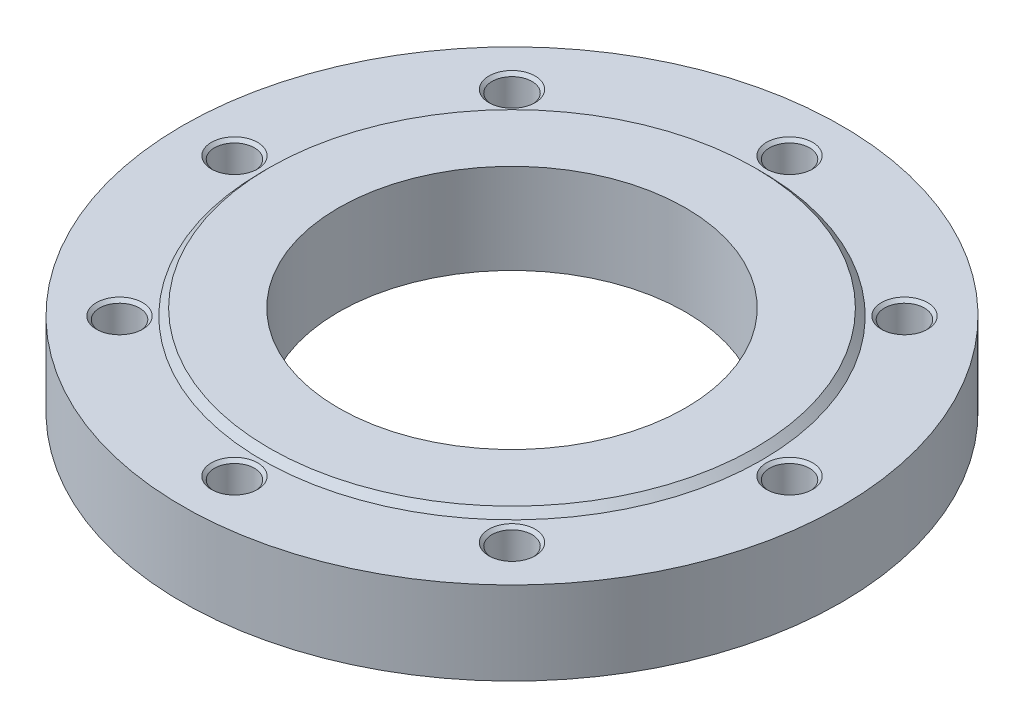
ISO-10303-21;
HEADER;
FILE_DESCRIPTION(('STEP AP214'),'2;1');
FILE_NAME('part.step','',(''),(''),'','','');
FILE_SCHEMA(('AUTOMOTIVE_DESIGN { 1 0 10303 214 1 1 1 1 }'));
ENDSEC;
DATA;
#1=APPLICATION_CONTEXT('core data for automotive mechanical design processes');
#2=APPLICATION_PROTOCOL_DEFINITION('international standard','automotive_design',2000,#1);
#3=PRODUCT_CONTEXT('',#1,'mechanical');
#4=PRODUCT('Part','Part','',(#3));
#5=PRODUCT_RELATED_PRODUCT_CATEGORY('part','',(#4));
#6=PRODUCT_DEFINITION_FORMATION('','',#4);
#7=PRODUCT_DEFINITION_CONTEXT('part definition',#1,'design');
#8=PRODUCT_DEFINITION('design','',#6,#7);
#9=PRODUCT_DEFINITION_SHAPE('','',#8);
#10=(LENGTH_UNIT() NAMED_UNIT(*) SI_UNIT(.MILLI.,.METRE.));
#11=(NAMED_UNIT(*) PLANE_ANGLE_UNIT() SI_UNIT($,.RADIAN.));
#12=(NAMED_UNIT(*) SI_UNIT($,.STERADIAN.) SOLID_ANGLE_UNIT());
#13=UNCERTAINTY_MEASURE_WITH_UNIT(LENGTH_MEASURE(1.E-05),#10,'distance_accuracy_value','');
#14=(GEOMETRIC_REPRESENTATION_CONTEXT(3) GLOBAL_UNCERTAINTY_ASSIGNED_CONTEXT((#13)) GLOBAL_UNIT_ASSIGNED_CONTEXT((#10,
#11,#12)) REPRESENTATION_CONTEXT('',''));
#15=CARTESIAN_POINT('',(0.,0.,0.));
#16=DIRECTION('',(0.,0.,1.));
#17=DIRECTION('',(1.,0.,0.));
#18=AXIS2_PLACEMENT_3D('',#15,#16,#17);
#19=CARTESIAN_POINT('',(0.,18.,0.));
#20=DIRECTION('',(0.,-1.,0.));
#21=DIRECTION('',(1.,0.,0.));
#22=AXIS2_PLACEMENT_3D('',#19,#20,#21);
#23=CYLINDRICAL_SURFACE('',#22,142.5);
#24=CARTESIAN_POINT('',(0.,0.,0.));
#25=DIRECTION('',(0.,1.,0.));
#26=DIRECTION('',(1.,0.,0.));
#27=AXIS2_PLACEMENT_3D('',#24,#25,#26);
#28=CIRCLE('',#27,142.5);
#29=CARTESIAN_POINT('',(142.5,0.,0.));
#30=VERTEX_POINT('',#29);
#31=EDGE_CURVE('E9',#30,#30,#28,.T.);
#32=ORIENTED_EDGE('',*,*,#31,.T.);
#33=EDGE_LOOP('',(#32));
#34=FACE_BOUND('',#33,.T.);
#35=CARTESIAN_POINT('',(0.,36.,0.));
#36=DIRECTION('',(0.,1.,0.));
#37=DIRECTION('',(1.,0.,0.));
#38=AXIS2_PLACEMENT_3D('',#35,#36,#37);
#39=CIRCLE('',#38,142.5);
#40=CARTESIAN_POINT('',(142.5,36.,0.));
#41=VERTEX_POINT('',#40);
#42=EDGE_CURVE('E147',#41,#41,#39,.T.);
#43=ORIENTED_EDGE('',*,*,#42,.F.);
#44=EDGE_LOOP('',(#43));
#45=FACE_BOUND('',#44,.T.);
#46=ADVANCED_FACE('F15',(#34,#45),#23,.T.);
#47=CARTESIAN_POINT('',(108.75,0.,0.));
#48=DIRECTION('',(0.,-1.,0.));
#49=DIRECTION('',(-1.,0.,0.));
#50=AXIS2_PLACEMENT_3D('',#47,#48,#49);
#51=PLANE('',#50);
#52=CARTESIAN_POINT('',(0.,0.,0.));
#53=DIRECTION('',(0.,1.,0.));
#54=DIRECTION('',(1.,0.,0.));
#55=AXIS2_PLACEMENT_3D('',#52,#53,#54);
#56=CIRCLE('',#55,75.);
#57=CARTESIAN_POINT('',(75.,0.,0.));
#58=VERTEX_POINT('',#57);
#59=EDGE_CURVE('E23',#58,#58,#56,.T.);
#60=ORIENTED_EDGE('',*,*,#59,.T.);
#61=EDGE_LOOP('',(#60));
#62=FACE_BOUND('',#61,.T.);
#63=ORIENTED_EDGE('',*,*,#31,.F.);
#64=EDGE_LOOP('',(#63));
#65=FACE_BOUND('',#64,.T.);
#66=ADVANCED_FACE('F299',(#62,#65),#51,.T.);
#67=CARTESIAN_POINT('',(0.,19.5,0.));
#68=DIRECTION('',(0.,-1.,0.));
#69=DIRECTION('',(1.,0.,0.));
#70=AXIS2_PLACEMENT_3D('',#67,#68,#69);
#71=CYLINDRICAL_SURFACE('',#70,75.);
#72=CARTESIAN_POINT('',(0.,39.,0.));
#73=DIRECTION('',(0.,1.,0.));
#74=DIRECTION('',(1.,0.,0.));
#75=AXIS2_PLACEMENT_3D('',#72,#73,#74);
#76=CIRCLE('',#75,75.);
#77=CARTESIAN_POINT('',(75.,39.,0.));
#78=VERTEX_POINT('',#77);
#79=EDGE_CURVE('E141',#78,#78,#76,.T.);
#80=ORIENTED_EDGE('',*,*,#79,.T.);
#81=EDGE_LOOP('',(#80));
#82=FACE_BOUND('',#81,.T.);
#83=ORIENTED_EDGE('',*,*,#59,.F.);
#84=EDGE_LOOP('',(#83));
#85=FACE_BOUND('',#84,.T.);
#86=ADVANCED_FACE('F142',(#82,#85),#71,.F.);
#87=CARTESIAN_POINT('',(90.,39.,0.));
#88=DIRECTION('',(0.,1.,0.));
#89=DIRECTION('',(1.,0.,0.));
#90=AXIS2_PLACEMENT_3D('',#87,#88,#89);
#91=PLANE('',#90);
#92=CARTESIAN_POINT('',(0.,39.,0.));
#93=DIRECTION('',(0.,1.,0.));
#94=DIRECTION('',(1.,0.,0.));
#95=AXIS2_PLACEMENT_3D('',#92,#93,#94);
#96=CIRCLE('',#95,105.);
#97=CARTESIAN_POINT('',(105.,39.,0.));
#98=VERTEX_POINT('',#97);
#99=EDGE_CURVE('E145',#98,#98,#96,.T.);
#100=ORIENTED_EDGE('',*,*,#99,.T.);
#101=EDGE_LOOP('',(#100));
#102=FACE_BOUND('',#101,.T.);
#103=ORIENTED_EDGE('',*,*,#79,.F.);
#104=EDGE_LOOP('',(#103));
#105=FACE_BOUND('',#104,.T.);
#106=ADVANCED_FACE('F425',(#102,#105),#91,.T.);
#107=CARTESIAN_POINT('',(0.,37.5,0.));
#108=DIRECTION('',(0.,-1.,0.));
#109=DIRECTION('',(1.,0.,0.));
#110=AXIS2_PLACEMENT_3D('',#107,#108,#109);
#111=CONICAL_SURFACE('',#110,106.5,0.785398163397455);
#112=CARTESIAN_POINT('',(0.,36.,0.));
#113=DIRECTION('',(0.,1.,0.));
#114=DIRECTION('',(1.,0.,0.));
#115=AXIS2_PLACEMENT_3D('',#112,#113,#114);
#116=CIRCLE('',#115,108.);
#117=CARTESIAN_POINT('',(108.,36.,0.));
#118=VERTEX_POINT('',#117);
#119=EDGE_CURVE('E151',#118,#118,#116,.T.);
#120=ORIENTED_EDGE('',*,*,#119,.T.);
#121=EDGE_LOOP('',(#120));
#122=FACE_BOUND('',#121,.T.);
#123=ORIENTED_EDGE('',*,*,#99,.F.);
#124=EDGE_LOOP('',(#123));
#125=FACE_BOUND('',#124,.T.);
#126=ADVANCED_FACE('F311',(#122,#125),#111,.T.);
#127=CARTESIAN_POINT('',(125.25,36.,0.));
#128=DIRECTION('',(0.,1.,0.));
#129=DIRECTION('',(1.,0.,0.));
#130=AXIS2_PLACEMENT_3D('',#127,#128,#129);
#131=PLANE('',#130);
#132=ORIENTED_EDGE('',*,*,#42,.T.);
#133=EDGE_LOOP('',(#132));
#134=FACE_BOUND('',#133,.T.);
#135=ORIENTED_EDGE('',*,*,#119,.F.);
#136=EDGE_LOOP('',(#135));
#137=FACE_BOUND('',#136,.T.);
#138=CARTESIAN_POINT('',(120.,36.,0.));
#139=DIRECTION('',(0.,-1.,0.));
#140=DIRECTION('',(1.,0.,0.));
#141=AXIS2_PLACEMENT_3D('',#138,#139,#140);
#142=CIRCLE('',#141,10.);
#143=CARTESIAN_POINT('',(130.,36.,0.));
#144=VERTEX_POINT('',#143);
#145=EDGE_CURVE('E160',#144,#144,#142,.T.);
#146=ORIENTED_EDGE('',*,*,#145,.T.);
#147=EDGE_LOOP('',(#146));
#148=FACE_BOUND('',#147,.T.);
#149=CARTESIAN_POINT('',(84.8528137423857,36.,-84.8528137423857));
#150=DIRECTION('',(0.,-1.,0.));
#151=DIRECTION('',(0.707106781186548,0.,-0.707106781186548));
#152=AXIS2_PLACEMENT_3D('',#149,#150,#151);
#153=CIRCLE('',#152,10.);
#154=CARTESIAN_POINT('',(91.9238815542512,36.,-91.9238815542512));
#155=VERTEX_POINT('',#154);
#156=EDGE_CURVE('E172',#155,#155,#153,.T.);
#157=ORIENTED_EDGE('',*,*,#156,.T.);
#158=EDGE_LOOP('',(#157));
#159=FACE_BOUND('',#158,.T.);
#160=CARTESIAN_POINT('',(0.,36.,-120.));
#161=DIRECTION('',(0.,-1.,0.));
#162=DIRECTION('',(0.,0.,-1.));
#163=AXIS2_PLACEMENT_3D('',#160,#161,#162);
#164=CIRCLE('',#163,10.);
#165=CARTESIAN_POINT('',(0.,36.,-130.));
#166=VERTEX_POINT('',#165);
#167=EDGE_CURVE('E186',#166,#166,#164,.T.);
#168=ORIENTED_EDGE('',*,*,#167,.T.);
#169=EDGE_LOOP('',(#168));
#170=FACE_BOUND('',#169,.T.);
#171=CARTESIAN_POINT('',(-84.8528137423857,36.,-84.8528137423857));
#172=DIRECTION('',(0.,-1.,0.));
#173=DIRECTION('',(-0.707106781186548,0.,-0.707106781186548));
#174=AXIS2_PLACEMENT_3D('',#171,#172,#173);
#175=CIRCLE('',#174,10.);
#176=CARTESIAN_POINT('',(-91.9238815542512,36.,-91.9238815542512));
#177=VERTEX_POINT('',#176);
#178=EDGE_CURVE('E199',#177,#177,#175,.T.);
#179=ORIENTED_EDGE('',*,*,#178,.T.);
#180=EDGE_LOOP('',(#179));
#181=FACE_BOUND('',#180,.T.);
#182=CARTESIAN_POINT('',(-120.,36.,0.));
#183=DIRECTION('',(0.,-1.,0.));
#184=DIRECTION('',(-1.,0.,0.));
#185=AXIS2_PLACEMENT_3D('',#182,#183,#184);
#186=CIRCLE('',#185,10.);
#187=CARTESIAN_POINT('',(-130.,36.,0.));
#188=VERTEX_POINT('',#187);
#189=EDGE_CURVE('E210',#188,#188,#186,.T.);
#190=ORIENTED_EDGE('',*,*,#189,.T.);
#191=EDGE_LOOP('',(#190));
#192=FACE_BOUND('',#191,.T.);
#193=CARTESIAN_POINT('',(-84.8528137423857,36.,84.8528137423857));
#194=DIRECTION('',(0.,-1.,0.));
#195=DIRECTION('',(-0.707106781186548,0.,0.707106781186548));
#196=AXIS2_PLACEMENT_3D('',#193,#194,#195);
#197=CIRCLE('',#196,10.);
#198=CARTESIAN_POINT('',(-91.9238815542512,36.,91.9238815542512));
#199=VERTEX_POINT('',#198);
#200=EDGE_CURVE('E223',#199,#199,#197,.T.);
#201=ORIENTED_EDGE('',*,*,#200,.T.);
#202=EDGE_LOOP('',(#201));
#203=FACE_BOUND('',#202,.T.);
#204=CARTESIAN_POINT('',(0.,36.,120.));
#205=DIRECTION('',(0.,-1.,0.));
#206=DIRECTION('',(0.,0.,1.));
#207=AXIS2_PLACEMENT_3D('',#204,#205,#206);
#208=CIRCLE('',#207,10.);
#209=CARTESIAN_POINT('',(0.,36.,130.));
#210=VERTEX_POINT('',#209);
#211=EDGE_CURVE('E239',#210,#210,#208,.T.);
#212=ORIENTED_EDGE('',*,*,#211,.T.);
#213=EDGE_LOOP('',(#212));
#214=FACE_BOUND('',#213,.T.);
#215=CARTESIAN_POINT('',(84.8528137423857,36.,84.8528137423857));
#216=DIRECTION('',(0.,-1.,0.));
#217=DIRECTION('',(0.707106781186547,0.,0.707106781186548));
#218=AXIS2_PLACEMENT_3D('',#215,#216,#217);
#219=CIRCLE('',#218,10.);
#220=CARTESIAN_POINT('',(91.9238815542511,36.,91.9238815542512));
#221=VERTEX_POINT('',#220);
#222=EDGE_CURVE('E251',#221,#221,#219,.T.);
#223=ORIENTED_EDGE('',*,*,#222,.T.);
#224=EDGE_LOOP('',(#223));
#225=FACE_BOUND('',#224,.T.);
#226=ADVANCED_FACE('F307',(#134,#137,#148,#159,#170,#181,#192,#203,#214,#225),#131,.T.);
#227=CARTESIAN_POINT('',(120.,5.50386219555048,0.));
#228=DIRECTION('',(0.,1.,0.));
#229=DIRECTION('',(1.,0.,0.));
#230=AXIS2_PLACEMENT_3D('',#227,#228,#229);
#231=CONICAL_SURFACE('',#230,4.3234375,1.0471975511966);
#232=CARTESIAN_POINT('',(120.,8.,0.));
#233=DIRECTION('',(0.,-1.,0.));
#234=DIRECTION('',(1.,0.,0.));
#235=AXIS2_PLACEMENT_3D('',#232,#233,#234);
#236=CIRCLE('',#235,8.646875);
#237=CARTESIAN_POINT('',(128.646875,8.,0.));
#238=VERTEX_POINT('',#237);
#239=EDGE_CURVE('E154',#238,#238,#236,.T.);
#240=ORIENTED_EDGE('',*,*,#239,.F.);
#241=EDGE_LOOP('',(#240));
#242=FACE_BOUND('',#241,.T.);
#243=CARTESIAN_POINT('',(120.,3.00772439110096,0.));
#244=VERTEX_POINT('',#243);
#245=VERTEX_LOOP('',#244);
#246=FACE_BOUND('',#245,.T.);
#247=ADVANCED_FACE('F310',(#242,#246),#231,.F.);
#248=CARTESIAN_POINT('',(120.,11.3234375,0.));
#249=DIRECTION('',(0.,1.,0.));
#250=DIRECTION('',(1.,0.,0.));
#251=AXIS2_PLACEMENT_3D('',#248,#249,#250);
#252=CYLINDRICAL_SURFACE('',#251,8.646875);
#253=CARTESIAN_POINT('',(120.,14.646875,0.));
#254=DIRECTION('',(0.,-1.,0.));
#255=DIRECTION('',(1.,0.,0.));
#256=AXIS2_PLACEMENT_3D('',#253,#254,#255);
#257=CIRCLE('',#256,8.646875);
#258=CARTESIAN_POINT('',(128.646875,14.646875,0.));
#259=VERTEX_POINT('',#258);
#260=EDGE_CURVE('E156',#259,#259,#257,.T.);
#261=ORIENTED_EDGE('',*,*,#260,.F.);
#262=EDGE_LOOP('',(#261));
#263=FACE_BOUND('',#262,.T.);
#264=ORIENTED_EDGE('',*,*,#239,.T.);
#265=EDGE_LOOP('',(#264));
#266=FACE_BOUND('',#265,.T.);
#267=ADVANCED_FACE('F563',(#263,#266),#252,.F.);
#268=CARTESIAN_POINT('',(120.,15.3234375,0.));
#269=DIRECTION('',(0.,1.,0.));
#270=DIRECTION('',(1.,0.,0.));
#271=AXIS2_PLACEMENT_3D('',#268,#269,#270);
#272=CONICAL_SURFACE('',#271,9.3234375,0.785398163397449);
#273=CARTESIAN_POINT('',(120.,16.,0.));
#274=DIRECTION('',(0.,-1.,0.));
#275=DIRECTION('',(1.,0.,0.));
#276=AXIS2_PLACEMENT_3D('',#273,#274,#275);
#277=CIRCLE('',#276,10.);
#278=CARTESIAN_POINT('',(130.,16.,0.));
#279=VERTEX_POINT('',#278);
#280=EDGE_CURVE('E157',#279,#279,#277,.T.);
#281=ORIENTED_EDGE('',*,*,#280,.F.);
#282=EDGE_LOOP('',(#281));
#283=FACE_BOUND('',#282,.T.);
#284=ORIENTED_EDGE('',*,*,#260,.T.);
#285=EDGE_LOOP('',(#284));
#286=FACE_BOUND('',#285,.T.);
#287=ADVANCED_FACE('F561',(#283,#286),#272,.F.);
#288=CARTESIAN_POINT('',(129.3234375,16.,0.));
#289=DIRECTION('',(0.,1.,0.));
#290=DIRECTION('',(-1.,0.,0.));
#291=AXIS2_PLACEMENT_3D('',#288,#289,#290);
#292=PLANE('',#291);
#293=CARTESIAN_POINT('',(120.,16.,0.));
#294=DIRECTION('',(0.,-1.,0.));
#295=DIRECTION('',(1.,0.,0.));
#296=AXIS2_PLACEMENT_3D('',#293,#294,#295);
#297=CIRCLE('',#296,8.646875);
#298=CARTESIAN_POINT('',(128.646875,16.,0.));
#299=VERTEX_POINT('',#298);
#300=EDGE_CURVE('E159',#299,#299,#297,.T.);
#301=ORIENTED_EDGE('',*,*,#300,.F.);
#302=EDGE_LOOP('',(#301));
#303=FACE_BOUND('',#302,.T.);
#304=ORIENTED_EDGE('',*,*,#280,.T.);
#305=EDGE_LOOP('',(#304));
#306=FACE_BOUND('',#305,.T.);
#307=ADVANCED_FACE('F488',(#303,#306),#292,.F.);
#308=CARTESIAN_POINT('',(120.,25.3234375,0.));
#309=DIRECTION('',(0.,1.,0.));
#310=DIRECTION('',(1.,0.,0.));
#311=AXIS2_PLACEMENT_3D('',#308,#309,#310);
#312=CYLINDRICAL_SURFACE('',#311,8.646875);
#313=CARTESIAN_POINT('',(120.,34.646875,0.));
#314=DIRECTION('',(0.,-1.,0.));
#315=DIRECTION('',(1.,0.,0.));
#316=AXIS2_PLACEMENT_3D('',#313,#314,#315);
#317=CIRCLE('',#316,8.646875);
#318=CARTESIAN_POINT('',(128.646875,34.646875,0.));
#319=VERTEX_POINT('',#318);
#320=EDGE_CURVE('E162',#319,#319,#317,.T.);
#321=ORIENTED_EDGE('',*,*,#320,.F.);
#322=EDGE_LOOP('',(#321));
#323=FACE_BOUND('',#322,.T.);
#324=ORIENTED_EDGE('',*,*,#300,.T.);
#325=EDGE_LOOP('',(#324));
#326=FACE_BOUND('',#325,.T.);
#327=ADVANCED_FACE('F485',(#323,#326),#312,.F.);
#328=CARTESIAN_POINT('',(120.,35.3234375,0.));
#329=DIRECTION('',(0.,1.,0.));
#330=DIRECTION('',(1.,0.,0.));
#331=AXIS2_PLACEMENT_3D('',#328,#329,#330);
#332=CONICAL_SURFACE('',#331,9.3234375,0.785398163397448);
#333=ORIENTED_EDGE('',*,*,#145,.F.);
#334=EDGE_LOOP('',(#333));
#335=FACE_BOUND('',#334,.T.);
#336=ORIENTED_EDGE('',*,*,#320,.T.);
#337=EDGE_LOOP('',(#336));
#338=FACE_BOUND('',#337,.T.);
#339=ADVANCED_FACE('F487',(#335,#338),#332,.F.);
#340=CARTESIAN_POINT('',(84.8528137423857,5.50386219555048,-84.8528137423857));
#341=DIRECTION('',(0.,1.,0.));
#342=DIRECTION('',(0.707106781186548,0.,-0.707106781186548));
#343=AXIS2_PLACEMENT_3D('',#340,#341,#342);
#344=CONICAL_SURFACE('',#343,4.3234375,1.0471975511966);
#345=CARTESIAN_POINT('',(84.8528137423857,8.,-84.8528137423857));
#346=DIRECTION('',(0.,-1.,0.));
#347=DIRECTION('',(0.707106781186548,0.,-0.707106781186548));
#348=AXIS2_PLACEMENT_3D('',#345,#346,#347);
#349=CIRCLE('',#348,8.646875);
#350=CARTESIAN_POINT('',(90.9670776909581,8.,-90.9670776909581));
#351=VERTEX_POINT('',#350);
#352=EDGE_CURVE('E165',#351,#351,#349,.T.);
#353=ORIENTED_EDGE('',*,*,#352,.F.);
#354=EDGE_LOOP('',(#353));
#355=FACE_BOUND('',#354,.T.);
#356=CARTESIAN_POINT('',(84.8528137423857,3.00772439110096,-84.8528137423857));
#357=VERTEX_POINT('',#356);
#358=VERTEX_LOOP('',#357);
#359=FACE_BOUND('',#358,.T.);
#360=ADVANCED_FACE('F551',(#355,#359),#344,.F.);
#361=CARTESIAN_POINT('',(84.8528137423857,11.3234375,-84.8528137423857));
#362=DIRECTION('',(0.,1.,0.));
#363=DIRECTION('',(0.707106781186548,0.,-0.707106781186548));
#364=AXIS2_PLACEMENT_3D('',#361,#362,#363);
#365=CYLINDRICAL_SURFACE('',#364,8.646875);
#366=CARTESIAN_POINT('',(84.8528137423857,14.646875,-84.8528137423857));
#367=DIRECTION('',(0.,-1.,0.));
#368=DIRECTION('',(0.707106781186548,0.,-0.707106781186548));
#369=AXIS2_PLACEMENT_3D('',#366,#367,#368);
#370=CIRCLE('',#369,8.646875);
#371=CARTESIAN_POINT('',(90.9670776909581,14.646875,-90.9670776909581));
#372=VERTEX_POINT('',#371);
#373=EDGE_CURVE('E166',#372,#372,#370,.T.);
#374=ORIENTED_EDGE('',*,*,#373,.F.);
#375=EDGE_LOOP('',(#374));
#376=FACE_BOUND('',#375,.T.);
#377=ORIENTED_EDGE('',*,*,#352,.T.);
#378=EDGE_LOOP('',(#377));
#379=FACE_BOUND('',#378,.T.);
#380=ADVANCED_FACE('F547',(#376,#379),#365,.F.);
#381=CARTESIAN_POINT('',(84.8528137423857,15.3234375,-84.8528137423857));
#382=DIRECTION('',(0.,1.,0.));
#383=DIRECTION('',(0.707106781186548,0.,-0.707106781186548));
#384=AXIS2_PLACEMENT_3D('',#381,#382,#383);
#385=CONICAL_SURFACE('',#384,9.3234375,0.785398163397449);
#386=CARTESIAN_POINT('',(84.8528137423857,16.,-84.8528137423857));
#387=DIRECTION('',(0.,-1.,0.));
#388=DIRECTION('',(0.707106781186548,0.,-0.707106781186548));
#389=AXIS2_PLACEMENT_3D('',#386,#387,#388);
#390=CIRCLE('',#389,10.);
#391=CARTESIAN_POINT('',(91.9238815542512,16.,-91.9238815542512));
#392=VERTEX_POINT('',#391);
#393=EDGE_CURVE('E168',#392,#392,#390,.T.);
#394=ORIENTED_EDGE('',*,*,#393,.F.);
#395=EDGE_LOOP('',(#394));
#396=FACE_BOUND('',#395,.T.);
#397=ORIENTED_EDGE('',*,*,#373,.T.);
#398=EDGE_LOOP('',(#397));
#399=FACE_BOUND('',#398,.T.);
#400=ADVANCED_FACE('F543',(#396,#399),#385,.F.);
#401=CARTESIAN_POINT('',(91.4454796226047,16.,-91.4454796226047));
#402=DIRECTION('',(0.,1.,0.));
#403=DIRECTION('',(-0.707106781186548,0.,0.707106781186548));
#404=AXIS2_PLACEMENT_3D('',#401,#402,#403);
#405=PLANE('',#404);
#406=CARTESIAN_POINT('',(84.8528137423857,16.,-84.8528137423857));
#407=DIRECTION('',(0.,-1.,0.));
#408=DIRECTION('',(0.707106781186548,0.,-0.707106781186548));
#409=AXIS2_PLACEMENT_3D('',#406,#407,#408);
#410=CIRCLE('',#409,8.646875);
#411=CARTESIAN_POINT('',(90.9670776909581,16.,-90.9670776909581));
#412=VERTEX_POINT('',#411);
#413=EDGE_CURVE('E170',#412,#412,#410,.T.);
#414=ORIENTED_EDGE('',*,*,#413,.F.);
#415=EDGE_LOOP('',(#414));
#416=FACE_BOUND('',#415,.T.);
#417=ORIENTED_EDGE('',*,*,#393,.T.);
#418=EDGE_LOOP('',(#417));
#419=FACE_BOUND('',#418,.T.);
#420=ADVANCED_FACE('F539',(#416,#419),#405,.F.);
#421=CARTESIAN_POINT('',(84.8528137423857,25.3234375,-84.8528137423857));
#422=DIRECTION('',(0.,1.,0.));
#423=DIRECTION('',(0.707106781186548,0.,-0.707106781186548));
#424=AXIS2_PLACEMENT_3D('',#421,#422,#423);
#425=CYLINDRICAL_SURFACE('',#424,8.646875);
#426=CARTESIAN_POINT('',(84.8528137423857,34.646875,-84.8528137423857));
#427=DIRECTION('',(0.,-1.,0.));
#428=DIRECTION('',(0.707106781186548,0.,-0.707106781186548));
#429=AXIS2_PLACEMENT_3D('',#426,#427,#428);
#430=CIRCLE('',#429,8.646875);
#431=CARTESIAN_POINT('',(90.9670776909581,34.646875,-90.9670776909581));
#432=VERTEX_POINT('',#431);
#433=EDGE_CURVE('E175',#432,#432,#430,.T.);
#434=ORIENTED_EDGE('',*,*,#433,.F.);
#435=EDGE_LOOP('',(#434));
#436=FACE_BOUND('',#435,.T.);
#437=ORIENTED_EDGE('',*,*,#413,.T.);
#438=EDGE_LOOP('',(#437));
#439=FACE_BOUND('',#438,.T.);
#440=ADVANCED_FACE('F533',(#436,#439),#425,.F.);
#441=CARTESIAN_POINT('',(84.8528137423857,35.3234375,-84.8528137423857));
#442=DIRECTION('',(0.,1.,0.));
#443=DIRECTION('',(0.707106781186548,0.,-0.707106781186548));
#444=AXIS2_PLACEMENT_3D('',#441,#442,#443);
#445=CONICAL_SURFACE('',#444,9.3234375,0.785398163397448);
#446=ORIENTED_EDGE('',*,*,#156,.F.);
#447=EDGE_LOOP('',(#446));
#448=FACE_BOUND('',#447,.T.);
#449=ORIENTED_EDGE('',*,*,#433,.T.);
#450=EDGE_LOOP('',(#449));
#451=FACE_BOUND('',#450,.T.);
#452=ADVANCED_FACE('F528',(#448,#451),#445,.F.);
#453=CARTESIAN_POINT('',(0.,5.50386219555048,-120.));
#454=DIRECTION('',(0.,1.,0.));
#455=DIRECTION('',(0.,0.,-1.));
#456=AXIS2_PLACEMENT_3D('',#453,#454,#455);
#457=CONICAL_SURFACE('',#456,4.3234375,1.0471975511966);
#458=CARTESIAN_POINT('',(0.,8.,-120.));
#459=DIRECTION('',(0.,-1.,0.));
#460=DIRECTION('',(0.,0.,-1.));
#461=AXIS2_PLACEMENT_3D('',#458,#459,#460);
#462=CIRCLE('',#461,8.646875);
#463=CARTESIAN_POINT('',(0.,8.,-128.646875));
#464=VERTEX_POINT('',#463);
#465=EDGE_CURVE('E177',#464,#464,#462,.T.);
#466=ORIENTED_EDGE('',*,*,#465,.F.);
#467=EDGE_LOOP('',(#466));
#468=FACE_BOUND('',#467,.T.);
#469=CARTESIAN_POINT('',(0.,3.00772439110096,-120.));
#470=VERTEX_POINT('',#469);
#471=VERTEX_LOOP('',#470);
#472=FACE_BOUND('',#471,.T.);
#473=ADVANCED_FACE('F522',(#468,#472),#457,.F.);
#474=CARTESIAN_POINT('',(0.,11.3234375,-120.));
#475=DIRECTION('',(0.,1.,0.));
#476=DIRECTION('',(0.,0.,-1.));
#477=AXIS2_PLACEMENT_3D('',#474,#475,#476);
#478=CYLINDRICAL_SURFACE('',#477,8.646875);
#479=CARTESIAN_POINT('',(0.,14.646875,-120.));
#480=DIRECTION('',(0.,-1.,0.));
#481=DIRECTION('',(0.,0.,-1.));
#482=AXIS2_PLACEMENT_3D('',#479,#480,#481);
#483=CIRCLE('',#482,8.646875);
#484=CARTESIAN_POINT('',(0.,14.646875,-128.646875));
#485=VERTEX_POINT('',#484);
#486=EDGE_CURVE('E179',#485,#485,#483,.T.);
#487=ORIENTED_EDGE('',*,*,#486,.F.);
#488=EDGE_LOOP('',(#487));
#489=FACE_BOUND('',#488,.T.);
#490=ORIENTED_EDGE('',*,*,#465,.T.);
#491=EDGE_LOOP('',(#490));
#492=FACE_BOUND('',#491,.T.);
#493=ADVANCED_FACE('F516',(#489,#492),#478,.F.);
#494=CARTESIAN_POINT('',(0.,15.3234375,-120.));
#495=DIRECTION('',(0.,1.,0.));
#496=DIRECTION('',(0.,0.,-1.));
#497=AXIS2_PLACEMENT_3D('',#494,#495,#496);
#498=CONICAL_SURFACE('',#497,9.3234375,0.785398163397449);
#499=CARTESIAN_POINT('',(0.,16.,-120.));
#500=DIRECTION('',(0.,-1.,0.));
#501=DIRECTION('',(0.,0.,-1.));
#502=AXIS2_PLACEMENT_3D('',#499,#500,#501);
#503=CIRCLE('',#502,10.);
#504=CARTESIAN_POINT('',(0.,16.,-130.));
#505=VERTEX_POINT('',#504);
#506=EDGE_CURVE('E182',#505,#505,#503,.T.);
#507=ORIENTED_EDGE('',*,*,#506,.F.);
#508=EDGE_LOOP('',(#507));
#509=FACE_BOUND('',#508,.T.);
#510=ORIENTED_EDGE('',*,*,#486,.T.);
#511=EDGE_LOOP('',(#510));
#512=FACE_BOUND('',#511,.T.);
#513=ADVANCED_FACE('F505',(#509,#512),#498,.F.);
#514=CARTESIAN_POINT('',(0.,16.,-129.3234375));
#515=DIRECTION('',(0.,1.,0.));
#516=DIRECTION('',(0.,0.,1.));
#517=AXIS2_PLACEMENT_3D('',#514,#515,#516);
#518=PLANE('',#517);
#519=CARTESIAN_POINT('',(0.,16.,-120.));
#520=DIRECTION('',(0.,-1.,0.));
#521=DIRECTION('',(0.,0.,-1.));
#522=AXIS2_PLACEMENT_3D('',#519,#520,#521);
#523=CIRCLE('',#522,8.646875);
#524=CARTESIAN_POINT('',(0.,16.,-128.646875));
#525=VERTEX_POINT('',#524);
#526=EDGE_CURVE('E184',#525,#525,#523,.T.);
#527=ORIENTED_EDGE('',*,*,#526,.F.);
#528=EDGE_LOOP('',(#527));
#529=FACE_BOUND('',#528,.T.);
#530=ORIENTED_EDGE('',*,*,#506,.T.);
#531=EDGE_LOOP('',(#530));
#532=FACE_BOUND('',#531,.T.);
#533=ADVANCED_FACE('F496',(#529,#532),#518,.F.);
#534=CARTESIAN_POINT('',(0.,25.3234375,-120.));
#535=DIRECTION('',(0.,1.,0.));
#536=DIRECTION('',(0.,0.,-1.));
#537=AXIS2_PLACEMENT_3D('',#534,#535,#536);
#538=CYLINDRICAL_SURFACE('',#537,8.646875);
#539=CARTESIAN_POINT('',(0.,34.646875,-120.));
#540=DIRECTION('',(0.,-1.,0.));
#541=DIRECTION('',(0.,0.,-1.));
#542=AXIS2_PLACEMENT_3D('',#539,#540,#541);
#543=CIRCLE('',#542,8.646875);
#544=CARTESIAN_POINT('',(0.,34.646875,-128.646875));
#545=VERTEX_POINT('',#544);
#546=EDGE_CURVE('E188',#545,#545,#543,.T.);
#547=ORIENTED_EDGE('',*,*,#546,.F.);
#548=EDGE_LOOP('',(#547));
#549=FACE_BOUND('',#548,.T.);
#550=ORIENTED_EDGE('',*,*,#526,.T.);
#551=EDGE_LOOP('',(#550));
#552=FACE_BOUND('',#551,.T.);
#553=ADVANCED_FACE('F493',(#549,#552),#538,.F.);
#554=CARTESIAN_POINT('',(0.,35.3234375,-120.));
#555=DIRECTION('',(0.,1.,0.));
#556=DIRECTION('',(0.,0.,-1.));
#557=AXIS2_PLACEMENT_3D('',#554,#555,#556);
#558=CONICAL_SURFACE('',#557,9.3234375,0.785398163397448);
#559=ORIENTED_EDGE('',*,*,#167,.F.);
#560=EDGE_LOOP('',(#559));
#561=FACE_BOUND('',#560,.T.);
#562=ORIENTED_EDGE('',*,*,#546,.T.);
#563=EDGE_LOOP('',(#562));
#564=FACE_BOUND('',#563,.T.);
#565=ADVANCED_FACE('F495',(#561,#564),#558,.F.);
#566=CARTESIAN_POINT('',(-84.8528137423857,5.50386219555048,-84.8528137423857));
#567=DIRECTION('',(0.,1.,0.));
#568=DIRECTION('',(-0.707106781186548,0.,-0.707106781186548));
#569=AXIS2_PLACEMENT_3D('',#566,#567,#568);
#570=CONICAL_SURFACE('',#569,4.3234375,1.0471975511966);
#571=CARTESIAN_POINT('',(-84.8528137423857,8.,-84.8528137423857));
#572=DIRECTION('',(0.,-1.,0.));
#573=DIRECTION('',(-0.707106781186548,0.,-0.707106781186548));
#574=AXIS2_PLACEMENT_3D('',#571,#572,#573);
#575=CIRCLE('',#574,8.646875);
#576=CARTESIAN_POINT('',(-90.9670776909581,8.,-90.9670776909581));
#577=VERTEX_POINT('',#576);
#578=EDGE_CURVE('E190',#577,#577,#575,.T.);
#579=ORIENTED_EDGE('',*,*,#578,.F.);
#580=EDGE_LOOP('',(#579));
#581=FACE_BOUND('',#580,.T.);
#582=CARTESIAN_POINT('',(-84.8528137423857,3.00772439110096,-84.8528137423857));
#583=VERTEX_POINT('',#582);
#584=VERTEX_LOOP('',#583);
#585=FACE_BOUND('',#584,.T.);
#586=ADVANCED_FACE('F502',(#581,#585),#570,.F.);
#587=CARTESIAN_POINT('',(-84.8528137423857,11.3234375,-84.8528137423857));
#588=DIRECTION('',(0.,1.,0.));
#589=DIRECTION('',(-0.707106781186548,0.,-0.707106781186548));
#590=AXIS2_PLACEMENT_3D('',#587,#588,#589);
#591=CYLINDRICAL_SURFACE('',#590,8.646875);
#592=CARTESIAN_POINT('',(-84.8528137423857,14.646875,-84.8528137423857));
#593=DIRECTION('',(0.,-1.,0.));
#594=DIRECTION('',(-0.707106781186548,0.,-0.707106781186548));
#595=AXIS2_PLACEMENT_3D('',#592,#593,#594);
#596=CIRCLE('',#595,8.646875);
#597=CARTESIAN_POINT('',(-90.9670776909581,14.646875,-90.9670776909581));
#598=VERTEX_POINT('',#597);
#599=EDGE_CURVE('E192',#598,#598,#596,.T.);
#600=ORIENTED_EDGE('',*,*,#599,.F.);
#601=EDGE_LOOP('',(#600));
#602=FACE_BOUND('',#601,.T.);
#603=ORIENTED_EDGE('',*,*,#578,.T.);
#604=EDGE_LOOP('',(#603));
#605=FACE_BOUND('',#604,.T.);
#606=ADVANCED_FACE('F687',(#602,#605),#591,.F.);
#607=CARTESIAN_POINT('',(-84.8528137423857,15.3234375,-84.8528137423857));
#608=DIRECTION('',(0.,1.,0.));
#609=DIRECTION('',(-0.707106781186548,0.,-0.707106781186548));
#610=AXIS2_PLACEMENT_3D('',#607,#608,#609);
#611=CONICAL_SURFACE('',#610,9.3234375,0.785398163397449);
#612=CARTESIAN_POINT('',(-84.8528137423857,16.,-84.8528137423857));
#613=DIRECTION('',(0.,-1.,0.));
#614=DIRECTION('',(-0.707106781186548,0.,-0.707106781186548));
#615=AXIS2_PLACEMENT_3D('',#612,#613,#614);
#616=CIRCLE('',#615,10.);
#617=CARTESIAN_POINT('',(-91.9238815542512,16.,-91.9238815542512));
#618=VERTEX_POINT('',#617);
#619=EDGE_CURVE('E194',#618,#618,#616,.T.);
#620=ORIENTED_EDGE('',*,*,#619,.F.);
#621=EDGE_LOOP('',(#620));
#622=FACE_BOUND('',#621,.T.);
#623=ORIENTED_EDGE('',*,*,#599,.T.);
#624=EDGE_LOOP('',(#623));
#625=FACE_BOUND('',#624,.T.);
#626=ADVANCED_FACE('F697',(#622,#625),#611,.F.);
#627=CARTESIAN_POINT('',(-91.4454796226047,16.,-91.4454796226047));
#628=DIRECTION('',(0.,1.,0.));
#629=DIRECTION('',(0.707106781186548,0.,0.707106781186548));
#630=AXIS2_PLACEMENT_3D('',#627,#628,#629);
#631=PLANE('',#630);
#632=CARTESIAN_POINT('',(-84.8528137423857,16.,-84.8528137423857));
#633=DIRECTION('',(0.,-1.,0.));
#634=DIRECTION('',(-0.707106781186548,0.,-0.707106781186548));
#635=AXIS2_PLACEMENT_3D('',#632,#633,#634);
#636=CIRCLE('',#635,8.646875);
#637=CARTESIAN_POINT('',(-90.9670776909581,16.,-90.9670776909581));
#638=VERTEX_POINT('',#637);
#639=EDGE_CURVE('E196',#638,#638,#636,.T.);
#640=ORIENTED_EDGE('',*,*,#639,.F.);
#641=EDGE_LOOP('',(#640));
#642=FACE_BOUND('',#641,.T.);
#643=ORIENTED_EDGE('',*,*,#619,.T.);
#644=EDGE_LOOP('',(#643));
#645=FACE_BOUND('',#644,.T.);
#646=ADVANCED_FACE('F707',(#642,#645),#631,.F.);
#647=CARTESIAN_POINT('',(-84.8528137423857,25.3234375,-84.8528137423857));
#648=DIRECTION('',(0.,1.,0.));
#649=DIRECTION('',(-0.707106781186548,0.,-0.707106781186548));
#650=AXIS2_PLACEMENT_3D('',#647,#648,#649);
#651=CYLINDRICAL_SURFACE('',#650,8.646875);
#652=CARTESIAN_POINT('',(-84.8528137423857,34.646875,-84.8528137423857));
#653=DIRECTION('',(0.,-1.,0.));
#654=DIRECTION('',(-0.707106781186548,0.,-0.707106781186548));
#655=AXIS2_PLACEMENT_3D('',#652,#653,#654);
#656=CIRCLE('',#655,8.646875);
#657=CARTESIAN_POINT('',(-90.9670776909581,34.646875,-90.9670776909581));
#658=VERTEX_POINT('',#657);
#659=EDGE_CURVE('E201',#658,#658,#656,.T.);
#660=ORIENTED_EDGE('',*,*,#659,.F.);
#661=EDGE_LOOP('',(#660));
#662=FACE_BOUND('',#661,.T.);
#663=ORIENTED_EDGE('',*,*,#639,.T.);
#664=EDGE_LOOP('',(#663));
#665=FACE_BOUND('',#664,.T.);
#666=ADVANCED_FACE('F295',(#662,#665),#651,.F.);
#667=CARTESIAN_POINT('',(-84.8528137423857,35.3234375,-84.8528137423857));
#668=DIRECTION('',(0.,1.,0.));
#669=DIRECTION('',(-0.707106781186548,0.,-0.707106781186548));
#670=AXIS2_PLACEMENT_3D('',#667,#668,#669);
#671=CONICAL_SURFACE('',#670,9.3234375,0.785398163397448);
#672=ORIENTED_EDGE('',*,*,#178,.F.);
#673=EDGE_LOOP('',(#672));
#674=FACE_BOUND('',#673,.T.);
#675=ORIENTED_EDGE('',*,*,#659,.T.);
#676=EDGE_LOOP('',(#675));
#677=FACE_BOUND('',#676,.T.);
#678=ADVANCED_FACE('F289',(#674,#677),#671,.F.);
#679=CARTESIAN_POINT('',(-120.,5.50386219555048,0.));
#680=DIRECTION('',(0.,1.,0.));
#681=DIRECTION('',(-1.,0.,0.));
#682=AXIS2_PLACEMENT_3D('',#679,#680,#681);
#683=CONICAL_SURFACE('',#682,4.3234375,1.0471975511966);
#684=CARTESIAN_POINT('',(-120.,8.,0.));
#685=DIRECTION('',(0.,-1.,0.));
#686=DIRECTION('',(-1.,0.,0.));
#687=AXIS2_PLACEMENT_3D('',#684,#685,#686);
#688=CIRCLE('',#687,8.646875);
#689=CARTESIAN_POINT('',(-128.646875,8.,0.));
#690=VERTEX_POINT('',#689);
#691=EDGE_CURVE('E203',#690,#690,#688,.T.);
#692=ORIENTED_EDGE('',*,*,#691,.F.);
#693=EDGE_LOOP('',(#692));
#694=FACE_BOUND('',#693,.T.);
#695=CARTESIAN_POINT('',(-120.,3.00772439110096,0.));
#696=VERTEX_POINT('',#695);
#697=VERTEX_LOOP('',#696);
#698=FACE_BOUND('',#697,.T.);
#699=ADVANCED_FACE('F283',(#694,#698),#683,.F.);
#700=CARTESIAN_POINT('',(-120.,11.3234375,0.));
#701=DIRECTION('',(0.,1.,0.));
#702=DIRECTION('',(-1.,0.,0.));
#703=AXIS2_PLACEMENT_3D('',#700,#701,#702);
#704=CYLINDRICAL_SURFACE('',#703,8.646875);
#705=CARTESIAN_POINT('',(-120.,14.646875,0.));
#706=DIRECTION('',(0.,-1.,0.));
#707=DIRECTION('',(-1.,0.,0.));
#708=AXIS2_PLACEMENT_3D('',#705,#706,#707);
#709=CIRCLE('',#708,8.646875);
#710=CARTESIAN_POINT('',(-128.646875,14.646875,0.));
#711=VERTEX_POINT('',#710);
#712=EDGE_CURVE('E205',#711,#711,#709,.T.);
#713=ORIENTED_EDGE('',*,*,#712,.F.);
#714=EDGE_LOOP('',(#713));
#715=FACE_BOUND('',#714,.T.);
#716=ORIENTED_EDGE('',*,*,#691,.T.);
#717=EDGE_LOOP('',(#716));
#718=FACE_BOUND('',#717,.T.);
#719=ADVANCED_FACE('F277',(#715,#718),#704,.F.);
#720=CARTESIAN_POINT('',(-120.,15.3234375,0.));
#721=DIRECTION('',(0.,1.,0.));
#722=DIRECTION('',(-1.,0.,0.));
#723=AXIS2_PLACEMENT_3D('',#720,#721,#722);
#724=CONICAL_SURFACE('',#723,9.3234375,0.785398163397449);
#725=CARTESIAN_POINT('',(-120.,16.,0.));
#726=DIRECTION('',(0.,-1.,0.));
#727=DIRECTION('',(-1.,0.,0.));
#728=AXIS2_PLACEMENT_3D('',#725,#726,#727);
#729=CIRCLE('',#728,10.);
#730=CARTESIAN_POINT('',(-130.,16.,0.));
#731=VERTEX_POINT('',#730);
#732=EDGE_CURVE('E207',#731,#731,#729,.T.);
#733=ORIENTED_EDGE('',*,*,#732,.F.);
#734=EDGE_LOOP('',(#733));
#735=FACE_BOUND('',#734,.T.);
#736=ORIENTED_EDGE('',*,*,#712,.T.);
#737=EDGE_LOOP('',(#736));
#738=FACE_BOUND('',#737,.T.);
#739=ADVANCED_FACE('F274',(#735,#738),#724,.F.);
#740=CARTESIAN_POINT('',(-129.3234375,16.,0.));
#741=DIRECTION('',(0.,1.,0.));
#742=DIRECTION('',(1.,0.,0.));
#743=AXIS2_PLACEMENT_3D('',#740,#741,#742);
#744=PLANE('',#743);
#745=CARTESIAN_POINT('',(-120.,16.,0.));
#746=DIRECTION('',(0.,-1.,0.));
#747=DIRECTION('',(-1.,0.,0.));
#748=AXIS2_PLACEMENT_3D('',#745,#746,#747);
#749=CIRCLE('',#748,8.646875);
#750=CARTESIAN_POINT('',(-128.646875,16.,0.));
#751=VERTEX_POINT('',#750);
#752=EDGE_CURVE('E208',#751,#751,#749,.T.);
#753=ORIENTED_EDGE('',*,*,#752,.F.);
#754=EDGE_LOOP('',(#753));
#755=FACE_BOUND('',#754,.T.);
#756=ORIENTED_EDGE('',*,*,#732,.T.);
#757=EDGE_LOOP('',(#756));
#758=FACE_BOUND('',#757,.T.);
#759=ADVANCED_FACE('F272',(#755,#758),#744,.F.);
#760=CARTESIAN_POINT('',(-120.,25.3234375,0.));
#761=DIRECTION('',(0.,1.,0.));
#762=DIRECTION('',(-1.,0.,0.));
#763=AXIS2_PLACEMENT_3D('',#760,#761,#762);
#764=CYLINDRICAL_SURFACE('',#763,8.646875);
#765=CARTESIAN_POINT('',(-120.,34.646875,0.));
#766=DIRECTION('',(0.,-1.,0.));
#767=DIRECTION('',(-1.,0.,0.));
#768=AXIS2_PLACEMENT_3D('',#765,#766,#767);
#769=CIRCLE('',#768,8.646875);
#770=CARTESIAN_POINT('',(-128.646875,34.646875,0.));
#771=VERTEX_POINT('',#770);
#772=EDGE_CURVE('E211',#771,#771,#769,.T.);
#773=ORIENTED_EDGE('',*,*,#772,.F.);
#774=EDGE_LOOP('',(#773));
#775=FACE_BOUND('',#774,.T.);
#776=ORIENTED_EDGE('',*,*,#752,.T.);
#777=EDGE_LOOP('',(#776));
#778=FACE_BOUND('',#777,.T.);
#779=ADVANCED_FACE('F420',(#775,#778),#764,.F.);
#780=CARTESIAN_POINT('',(-120.,35.3234375,0.));
#781=DIRECTION('',(0.,1.,0.));
#782=DIRECTION('',(-1.,0.,0.));
#783=AXIS2_PLACEMENT_3D('',#780,#781,#782);
#784=CONICAL_SURFACE('',#783,9.3234375,0.785398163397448);
#785=ORIENTED_EDGE('',*,*,#189,.F.);
#786=EDGE_LOOP('',(#785));
#787=FACE_BOUND('',#786,.T.);
#788=ORIENTED_EDGE('',*,*,#772,.T.);
#789=EDGE_LOOP('',(#788));
#790=FACE_BOUND('',#789,.T.);
#791=ADVANCED_FACE('F410',(#787,#790),#784,.F.);
#792=CARTESIAN_POINT('',(-84.8528137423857,5.50386219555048,84.8528137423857));
#793=DIRECTION('',(0.,1.,0.));
#794=DIRECTION('',(-0.707106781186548,0.,0.707106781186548));
#795=AXIS2_PLACEMENT_3D('',#792,#793,#794);
#796=CONICAL_SURFACE('',#795,4.3234375,1.0471975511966);
#797=CARTESIAN_POINT('',(-84.8528137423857,8.,84.8528137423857));
#798=DIRECTION('',(0.,-1.,0.));
#799=DIRECTION('',(-0.707106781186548,0.,0.707106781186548));
#800=AXIS2_PLACEMENT_3D('',#797,#798,#799);
#801=CIRCLE('',#800,8.646875);
#802=CARTESIAN_POINT('',(-90.9670776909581,8.,90.9670776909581));
#803=VERTEX_POINT('',#802);
#804=EDGE_CURVE('E213',#803,#803,#801,.T.);
#805=ORIENTED_EDGE('',*,*,#804,.F.);
#806=EDGE_LOOP('',(#805));
#807=FACE_BOUND('',#806,.T.);
#808=CARTESIAN_POINT('',(-84.8528137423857,3.00772439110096,84.8528137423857));
#809=VERTEX_POINT('',#808);
#810=VERTEX_LOOP('',#809);
#811=FACE_BOUND('',#810,.T.);
#812=ADVANCED_FACE('F407',(#807,#811),#796,.F.);
#813=CARTESIAN_POINT('',(-84.8528137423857,11.3234375,84.8528137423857));
#814=DIRECTION('',(0.,1.,0.));
#815=DIRECTION('',(-0.707106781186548,0.,0.707106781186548));
#816=AXIS2_PLACEMENT_3D('',#813,#814,#815);
#817=CYLINDRICAL_SURFACE('',#816,8.646875);
#818=CARTESIAN_POINT('',(-84.8528137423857,14.646875,84.8528137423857));
#819=DIRECTION('',(0.,-1.,0.));
#820=DIRECTION('',(-0.707106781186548,0.,0.707106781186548));
#821=AXIS2_PLACEMENT_3D('',#818,#819,#820);
#822=CIRCLE('',#821,8.646875);
#823=CARTESIAN_POINT('',(-90.9670776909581,14.646875,90.9670776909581));
#824=VERTEX_POINT('',#823);
#825=EDGE_CURVE('E216',#824,#824,#822,.T.);
#826=ORIENTED_EDGE('',*,*,#825,.F.);
#827=EDGE_LOOP('',(#826));
#828=FACE_BOUND('',#827,.T.);
#829=ORIENTED_EDGE('',*,*,#804,.T.);
#830=EDGE_LOOP('',(#829));
#831=FACE_BOUND('',#830,.T.);
#832=ADVANCED_FACE('F405',(#828,#831),#817,.F.);
#833=CARTESIAN_POINT('',(-84.8528137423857,15.3234375,84.8528137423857));
#834=DIRECTION('',(0.,1.,0.));
#835=DIRECTION('',(-0.707106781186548,0.,0.707106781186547));
#836=AXIS2_PLACEMENT_3D('',#833,#834,#835);
#837=CONICAL_SURFACE('',#836,9.3234375,0.785398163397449);
#838=CARTESIAN_POINT('',(-84.8528137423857,16.,84.8528137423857));
#839=DIRECTION('',(0.,-1.,0.));
#840=DIRECTION('',(-0.707106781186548,0.,0.707106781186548));
#841=AXIS2_PLACEMENT_3D('',#838,#839,#840);
#842=CIRCLE('',#841,10.);
#843=CARTESIAN_POINT('',(-91.9238815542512,16.,91.9238815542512));
#844=VERTEX_POINT('',#843);
#845=EDGE_CURVE('E219',#844,#844,#842,.T.);
#846=ORIENTED_EDGE('',*,*,#845,.F.);
#847=EDGE_LOOP('',(#846));
#848=FACE_BOUND('',#847,.T.);
#849=ORIENTED_EDGE('',*,*,#825,.T.);
#850=EDGE_LOOP('',(#849));
#851=FACE_BOUND('',#850,.T.);
#852=ADVANCED_FACE('F417',(#848,#851),#837,.F.);
#853=CARTESIAN_POINT('',(-91.4454796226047,16.,91.4454796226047));
#854=DIRECTION('',(0.,1.,0.));
#855=DIRECTION('',(0.707106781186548,0.,-0.707106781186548));
#856=AXIS2_PLACEMENT_3D('',#853,#854,#855);
#857=PLANE('',#856);
#858=CARTESIAN_POINT('',(-84.8528137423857,16.,84.8528137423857));
#859=DIRECTION('',(0.,-1.,0.));
#860=DIRECTION('',(-0.707106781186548,0.,0.707106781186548));
#861=AXIS2_PLACEMENT_3D('',#858,#859,#860);
#862=CIRCLE('',#861,8.646875);
#863=CARTESIAN_POINT('',(-90.9670776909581,16.,90.9670776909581));
#864=VERTEX_POINT('',#863);
#865=EDGE_CURVE('E220',#864,#864,#862,.T.);
#866=ORIENTED_EDGE('',*,*,#865,.F.);
#867=EDGE_LOOP('',(#866));
#868=FACE_BOUND('',#867,.T.);
#869=ORIENTED_EDGE('',*,*,#845,.T.);
#870=EDGE_LOOP('',(#869));
#871=FACE_BOUND('',#870,.T.);
#872=ADVANCED_FACE('F466',(#868,#871),#857,.F.);
#873=CARTESIAN_POINT('',(-84.8528137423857,25.3234375,84.8528137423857));
#874=DIRECTION('',(0.,1.,0.));
#875=DIRECTION('',(-0.707106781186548,0.,0.707106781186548));
#876=AXIS2_PLACEMENT_3D('',#873,#874,#875);
#877=CYLINDRICAL_SURFACE('',#876,8.646875);
#878=CARTESIAN_POINT('',(-84.8528137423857,34.646875,84.8528137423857));
#879=DIRECTION('',(0.,-1.,0.));
#880=DIRECTION('',(-0.707106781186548,0.,0.707106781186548));
#881=AXIS2_PLACEMENT_3D('',#878,#879,#880);
#882=CIRCLE('',#881,8.646875);
#883=CARTESIAN_POINT('',(-90.9670776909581,34.646875,90.9670776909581));
#884=VERTEX_POINT('',#883);
#885=EDGE_CURVE('E227',#884,#884,#882,.T.);
#886=ORIENTED_EDGE('',*,*,#885,.F.);
#887=EDGE_LOOP('',(#886));
#888=FACE_BOUND('',#887,.T.);
#889=ORIENTED_EDGE('',*,*,#865,.T.);
#890=EDGE_LOOP('',(#889));
#891=FACE_BOUND('',#890,.T.);
#892=ADVANCED_FACE('F463',(#888,#891),#877,.F.);
#893=CARTESIAN_POINT('',(-84.8528137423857,35.3234375,84.8528137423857));
#894=DIRECTION('',(0.,1.,0.));
#895=DIRECTION('',(-0.707106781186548,0.,0.707106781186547));
#896=AXIS2_PLACEMENT_3D('',#893,#894,#895);
#897=CONICAL_SURFACE('',#896,9.3234375,0.785398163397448);
#898=ORIENTED_EDGE('',*,*,#200,.F.);
#899=EDGE_LOOP('',(#898));
#900=FACE_BOUND('',#899,.T.);
#901=ORIENTED_EDGE('',*,*,#885,.T.);
#902=EDGE_LOOP('',(#901));
#903=FACE_BOUND('',#902,.T.);
#904=ADVANCED_FACE('F461',(#900,#903),#897,.F.);
#905=CARTESIAN_POINT('',(0.,5.50386219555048,120.));
#906=DIRECTION('',(0.,1.,0.));
#907=DIRECTION('',(0.,0.,1.));
#908=AXIS2_PLACEMENT_3D('',#905,#906,#907);
#909=CONICAL_SURFACE('',#908,4.3234375,1.0471975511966);
#910=CARTESIAN_POINT('',(0.,8.,120.));
#911=DIRECTION('',(0.,-1.,0.));
#912=DIRECTION('',(0.,0.,1.));
#913=AXIS2_PLACEMENT_3D('',#910,#911,#912);
#914=CIRCLE('',#913,8.646875);
#915=CARTESIAN_POINT('',(0.,8.,128.646875));
#916=VERTEX_POINT('',#915);
#917=EDGE_CURVE('E224',#916,#916,#914,.T.);
#918=ORIENTED_EDGE('',*,*,#917,.F.);
#919=EDGE_LOOP('',(#918));
#920=FACE_BOUND('',#919,.T.);
#921=CARTESIAN_POINT('',(0.,3.00772439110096,120.));
#922=VERTEX_POINT('',#921);
#923=VERTEX_LOOP('',#922);
#924=FACE_BOUND('',#923,.T.);
#925=ADVANCED_FACE('F459',(#920,#924),#909,.F.);
#926=CARTESIAN_POINT('',(0.,11.3234375,120.));
#927=DIRECTION('',(0.,1.,0.));
#928=DIRECTION('',(0.,0.,1.));
#929=AXIS2_PLACEMENT_3D('',#926,#927,#928);
#930=CYLINDRICAL_SURFACE('',#929,8.646875);
#931=CARTESIAN_POINT('',(0.,14.646875,120.));
#932=DIRECTION('',(0.,-1.,0.));
#933=DIRECTION('',(0.,0.,1.));
#934=AXIS2_PLACEMENT_3D('',#931,#932,#933);
#935=CIRCLE('',#934,8.646875);
#936=CARTESIAN_POINT('',(0.,14.646875,128.646875));
#937=VERTEX_POINT('',#936);
#938=EDGE_CURVE('E228',#937,#937,#935,.T.);
#939=ORIENTED_EDGE('',*,*,#938,.F.);
#940=EDGE_LOOP('',(#939));
#941=FACE_BOUND('',#940,.T.);
#942=ORIENTED_EDGE('',*,*,#917,.T.);
#943=EDGE_LOOP('',(#942));
#944=FACE_BOUND('',#943,.T.);
#945=ADVANCED_FACE('F452',(#941,#944),#930,.F.);
#946=CARTESIAN_POINT('',(0.,15.3234375,120.));
#947=DIRECTION('',(0.,1.,0.));
#948=DIRECTION('',(0.,0.,1.));
#949=AXIS2_PLACEMENT_3D('',#946,#947,#948);
#950=CONICAL_SURFACE('',#949,9.3234375,0.785398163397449);
#951=CARTESIAN_POINT('',(0.,16.,120.));
#952=DIRECTION('',(0.,-1.,0.));
#953=DIRECTION('',(0.,0.,1.));
#954=AXIS2_PLACEMENT_3D('',#951,#952,#953);
#955=CIRCLE('',#954,10.);
#956=CARTESIAN_POINT('',(0.,16.,130.));
#957=VERTEX_POINT('',#956);
#958=EDGE_CURVE('E233',#957,#957,#955,.T.);
#959=ORIENTED_EDGE('',*,*,#958,.F.);
#960=EDGE_LOOP('',(#959));
#961=FACE_BOUND('',#960,.T.);
#962=ORIENTED_EDGE('',*,*,#938,.T.);
#963=EDGE_LOOP('',(#962));
#964=FACE_BOUND('',#963,.T.);
#965=ADVANCED_FACE('F449',(#961,#964),#950,.F.);
#966=CARTESIAN_POINT('',(0.,16.,129.3234375));
#967=DIRECTION('',(0.,1.,0.));
#968=DIRECTION('',(0.,0.,-1.));
#969=AXIS2_PLACEMENT_3D('',#966,#967,#968);
#970=PLANE('',#969);
#971=CARTESIAN_POINT('',(0.,16.,120.));
#972=DIRECTION('',(0.,-1.,0.));
#973=DIRECTION('',(0.,0.,1.));
#974=AXIS2_PLACEMENT_3D('',#971,#972,#973);
#975=CIRCLE('',#974,8.646875);
#976=CARTESIAN_POINT('',(0.,16.,128.646875));
#977=VERTEX_POINT('',#976);
#978=EDGE_CURVE('E236',#977,#977,#975,.T.);
#979=ORIENTED_EDGE('',*,*,#978,.F.);
#980=EDGE_LOOP('',(#979));
#981=FACE_BOUND('',#980,.T.);
#982=ORIENTED_EDGE('',*,*,#958,.T.);
#983=EDGE_LOOP('',(#982));
#984=FACE_BOUND('',#983,.T.);
#985=ADVANCED_FACE('F447',(#981,#984),#970,.F.);
#986=CARTESIAN_POINT('',(0.,25.3234375,120.));
#987=DIRECTION('',(0.,1.,0.));
#988=DIRECTION('',(0.,0.,1.));
#989=AXIS2_PLACEMENT_3D('',#986,#987,#988);
#990=CYLINDRICAL_SURFACE('',#989,8.646875);
#991=CARTESIAN_POINT('',(0.,34.646875,120.));
#992=DIRECTION('',(0.,-1.,0.));
#993=DIRECTION('',(0.,0.,1.));
#994=AXIS2_PLACEMENT_3D('',#991,#992,#993);
#995=CIRCLE('',#994,8.646875);
#996=CARTESIAN_POINT('',(0.,34.646875,128.646875));
#997=VERTEX_POINT('',#996);
#998=EDGE_CURVE('E253',#997,#997,#995,.T.);
#999=ORIENTED_EDGE('',*,*,#998,.F.);
#1000=EDGE_LOOP('',(#999));
#1001=FACE_BOUND('',#1000,.T.);
#1002=ORIENTED_EDGE('',*,*,#978,.T.);
#1003=EDGE_LOOP('',(#1002));
#1004=FACE_BOUND('',#1003,.T.);
#1005=ADVANCED_FACE('F444',(#1001,#1004),#990,.F.);
#1006=CARTESIAN_POINT('',(0.,35.3234375,120.));
#1007=DIRECTION('',(0.,1.,0.));
#1008=DIRECTION('',(0.,0.,1.));
#1009=AXIS2_PLACEMENT_3D('',#1006,#1007,#1008);
#1010=CONICAL_SURFACE('',#1009,9.3234375,0.785398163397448);
#1011=ORIENTED_EDGE('',*,*,#211,.F.);
#1012=EDGE_LOOP('',(#1011));
#1013=FACE_BOUND('',#1012,.T.);
#1014=ORIENTED_EDGE('',*,*,#998,.T.);
#1015=EDGE_LOOP('',(#1014));
#1016=FACE_BOUND('',#1015,.T.);
#1017=ADVANCED_FACE('F378',(#1013,#1016),#1010,.F.);
#1018=CARTESIAN_POINT('',(84.8528137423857,5.50386219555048,84.8528137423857));
#1019=DIRECTION('',(0.,1.,0.));
#1020=DIRECTION('',(0.707106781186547,0.,0.707106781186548));
#1021=AXIS2_PLACEMENT_3D('',#1018,#1019,#1020);
#1022=CONICAL_SURFACE('',#1021,4.3234375,1.0471975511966);
#1023=CARTESIAN_POINT('',(84.8528137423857,8.,84.8528137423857));
#1024=DIRECTION('',(0.,-1.,0.));
#1025=DIRECTION('',(0.707106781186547,0.,0.707106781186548));
#1026=AXIS2_PLACEMENT_3D('',#1023,#1024,#1025);
#1027=CIRCLE('',#1026,8.646875);
#1028=CARTESIAN_POINT('',(90.9670776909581,8.,90.9670776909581));
#1029=VERTEX_POINT('',#1028);
#1030=EDGE_CURVE('E243',#1029,#1029,#1027,.T.);
#1031=ORIENTED_EDGE('',*,*,#1030,.F.);
#1032=EDGE_LOOP('',(#1031));
#1033=FACE_BOUND('',#1032,.T.);
#1034=CARTESIAN_POINT('',(84.8528137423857,3.00772439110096,84.8528137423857));
#1035=VERTEX_POINT('',#1034);
#1036=VERTEX_LOOP('',#1035);
#1037=FACE_BOUND('',#1036,.T.);
#1038=ADVANCED_FACE('F370',(#1033,#1037),#1022,.F.);
#1039=CARTESIAN_POINT('',(84.8528137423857,11.3234375,84.8528137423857));
#1040=DIRECTION('',(0.,1.,0.));
#1041=DIRECTION('',(0.707106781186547,0.,0.707106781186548));
#1042=AXIS2_PLACEMENT_3D('',#1039,#1040,#1041);
#1043=CYLINDRICAL_SURFACE('',#1042,8.646875);
#1044=CARTESIAN_POINT('',(84.8528137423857,14.646875,84.8528137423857));
#1045=DIRECTION('',(0.,-1.,0.));
#1046=DIRECTION('',(0.707106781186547,0.,0.707106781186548));
#1047=AXIS2_PLACEMENT_3D('',#1044,#1045,#1046);
#1048=CIRCLE('',#1047,8.646875);
#1049=CARTESIAN_POINT('',(90.9670776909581,14.646875,90.9670776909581));
#1050=VERTEX_POINT('',#1049);
#1051=EDGE_CURVE('E240',#1050,#1050,#1048,.T.);
#1052=ORIENTED_EDGE('',*,*,#1051,.F.);
#1053=EDGE_LOOP('',(#1052));
#1054=FACE_BOUND('',#1053,.T.);
#1055=ORIENTED_EDGE('',*,*,#1030,.T.);
#1056=EDGE_LOOP('',(#1055));
#1057=FACE_BOUND('',#1056,.T.);
#1058=ADVANCED_FACE('F362',(#1054,#1057),#1043,.F.);
#1059=CARTESIAN_POINT('',(84.8528137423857,15.3234375,84.8528137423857));
#1060=DIRECTION('',(0.,1.,0.));
#1061=DIRECTION('',(0.707106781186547,0.,0.707106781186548));
#1062=AXIS2_PLACEMENT_3D('',#1059,#1060,#1061);
#1063=CONICAL_SURFACE('',#1062,9.3234375,0.785398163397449);
#1064=CARTESIAN_POINT('',(84.8528137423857,16.,84.8528137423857));
#1065=DIRECTION('',(0.,-1.,0.));
#1066=DIRECTION('',(0.707106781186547,0.,0.707106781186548));
#1067=AXIS2_PLACEMENT_3D('',#1064,#1065,#1066);
#1068=CIRCLE('',#1067,10.);
#1069=CARTESIAN_POINT('',(91.9238815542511,16.,91.9238815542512));
#1070=VERTEX_POINT('',#1069);
#1071=EDGE_CURVE('E244',#1070,#1070,#1068,.T.);
#1072=ORIENTED_EDGE('',*,*,#1071,.F.);
#1073=EDGE_LOOP('',(#1072));
#1074=FACE_BOUND('',#1073,.T.);
#1075=ORIENTED_EDGE('',*,*,#1051,.T.);
#1076=EDGE_LOOP('',(#1075));
#1077=FACE_BOUND('',#1076,.T.);
#1078=ADVANCED_FACE('F354',(#1074,#1077),#1063,.F.);
#1079=CARTESIAN_POINT('',(91.4454796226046,16.,91.4454796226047));
#1080=DIRECTION('',(0.,1.,0.));
#1081=DIRECTION('',(-0.707106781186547,0.,-0.707106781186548));
#1082=AXIS2_PLACEMENT_3D('',#1079,#1080,#1081);
#1083=PLANE('',#1082);
#1084=CARTESIAN_POINT('',(84.8528137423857,16.,84.8528137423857));
#1085=DIRECTION('',(0.,-1.,0.));
#1086=DIRECTION('',(0.707106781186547,0.,0.707106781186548));
#1087=AXIS2_PLACEMENT_3D('',#1084,#1085,#1086);
#1088=CIRCLE('',#1087,8.646875);
#1089=CARTESIAN_POINT('',(90.9670776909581,16.,90.9670776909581));
#1090=VERTEX_POINT('',#1089);
#1091=EDGE_CURVE('E248',#1090,#1090,#1088,.T.);
#1092=ORIENTED_EDGE('',*,*,#1091,.F.);
#1093=EDGE_LOOP('',(#1092));
#1094=FACE_BOUND('',#1093,.T.);
#1095=ORIENTED_EDGE('',*,*,#1071,.T.);
#1096=EDGE_LOOP('',(#1095));
#1097=FACE_BOUND('',#1096,.T.);
#1098=ADVANCED_FACE('F346',(#1094,#1097),#1083,.F.);
#1099=CARTESIAN_POINT('',(84.8528137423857,25.3234375,84.8528137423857));
#1100=DIRECTION('',(0.,1.,0.));
#1101=DIRECTION('',(0.707106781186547,0.,0.707106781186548));
#1102=AXIS2_PLACEMENT_3D('',#1099,#1100,#1101);
#1103=CYLINDRICAL_SURFACE('',#1102,8.646875);
#1104=CARTESIAN_POINT('',(84.8528137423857,34.646875,84.8528137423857));
#1105=DIRECTION('',(0.,-1.,0.));
#1106=DIRECTION('',(0.707106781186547,0.,0.707106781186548));
#1107=AXIS2_PLACEMENT_3D('',#1104,#1105,#1106);
#1108=CIRCLE('',#1107,8.646875);
#1109=CARTESIAN_POINT('',(90.9670776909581,34.646875,90.9670776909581));
#1110=VERTEX_POINT('',#1109);
#1111=EDGE_CURVE('E260',#1110,#1110,#1108,.T.);
#1112=ORIENTED_EDGE('',*,*,#1111,.F.);
#1113=EDGE_LOOP('',(#1112));
#1114=FACE_BOUND('',#1113,.T.);
#1115=ORIENTED_EDGE('',*,*,#1091,.T.);
#1116=EDGE_LOOP('',(#1115));
#1117=FACE_BOUND('',#1116,.T.);
#1118=ADVANCED_FACE('F339',(#1114,#1117),#1103,.F.);
#1119=CARTESIAN_POINT('',(84.8528137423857,35.3234375,84.8528137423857));
#1120=DIRECTION('',(0.,1.,0.));
#1121=DIRECTION('',(0.707106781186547,0.,0.707106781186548));
#1122=AXIS2_PLACEMENT_3D('',#1119,#1120,#1121);
#1123=CONICAL_SURFACE('',#1122,9.3234375,0.785398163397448);
#1124=ORIENTED_EDGE('',*,*,#222,.F.);
#1125=EDGE_LOOP('',(#1124));
#1126=FACE_BOUND('',#1125,.T.);
#1127=ORIENTED_EDGE('',*,*,#1111,.T.);
#1128=EDGE_LOOP('',(#1127));
#1129=FACE_BOUND('',#1128,.T.);
#1130=ADVANCED_FACE('F336',(#1126,#1129),#1123,.F.);
#1131=CLOSED_SHELL('',(#46,#66,#86,#106,#126,#226,#247,#267,#287,#307,#327,#339,#360,#380,#400,
#420,#440,#452,#473,#493,#513,#533,#553,#565,#586,#606,#626,#646,#666,#678,#699,#719,#739,#759,
#779,#791,#812,#832,#852,#872,#892,#904,#925,#945,#965,#985,#1005,#1017,#1038,#1058,#1078,#1098,
#1118,#1130));
#1132=MANIFOLD_SOLID_BREP('B1',#1131);
#1133=ADVANCED_BREP_SHAPE_REPRESENTATION('',(#18,#1132),#14);
#1134=SHAPE_DEFINITION_REPRESENTATION(#9,#1133);
ENDSEC;
END-ISO-10303-21;
